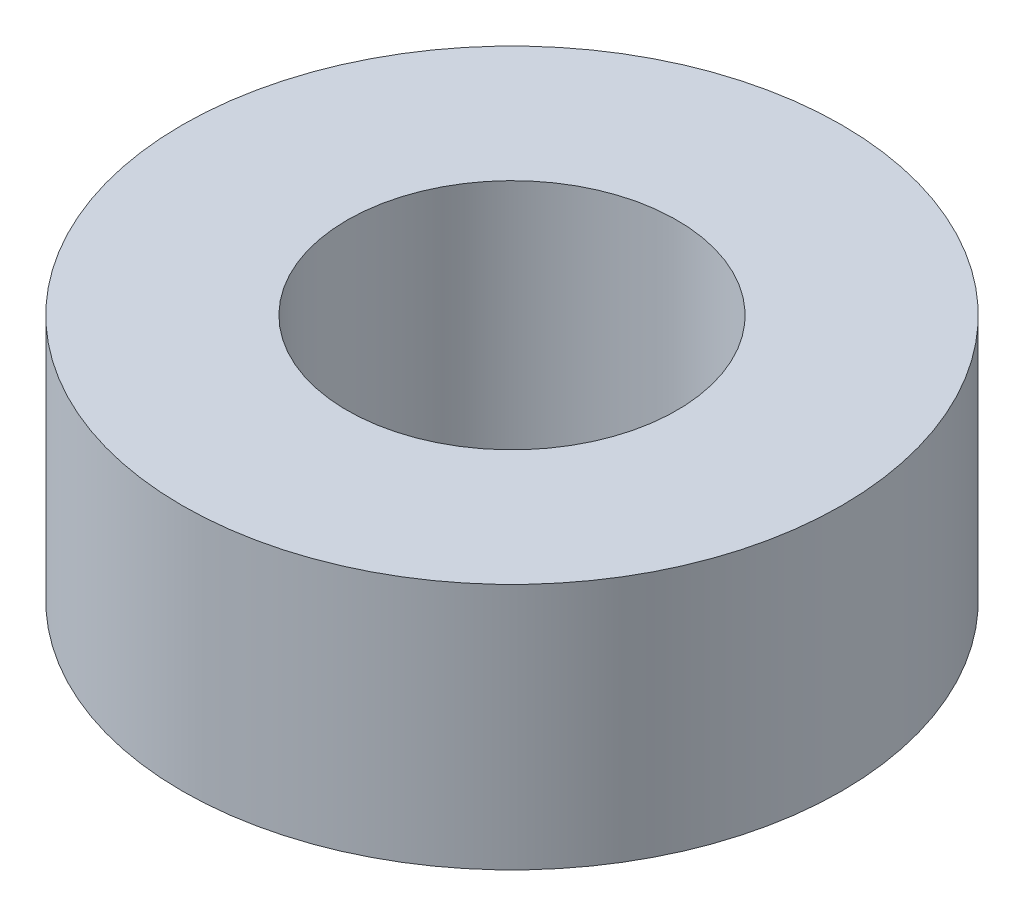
from build123d import *

# Parameters (mm, degrees)
SKETCH1_W = 10
SKETCH1_H = 15


with BuildPart() as part:
    # Sketch1 → Revolve1 (revolve)
    with BuildSketch(Plane.XY):
        with Locations((-15, -7.5)):
            Rectangle(SKETCH1_W, SKETCH1_H)
    revolve(axis=Axis((0, 0, 0), (0, -1, 0)))


solid = part.part
